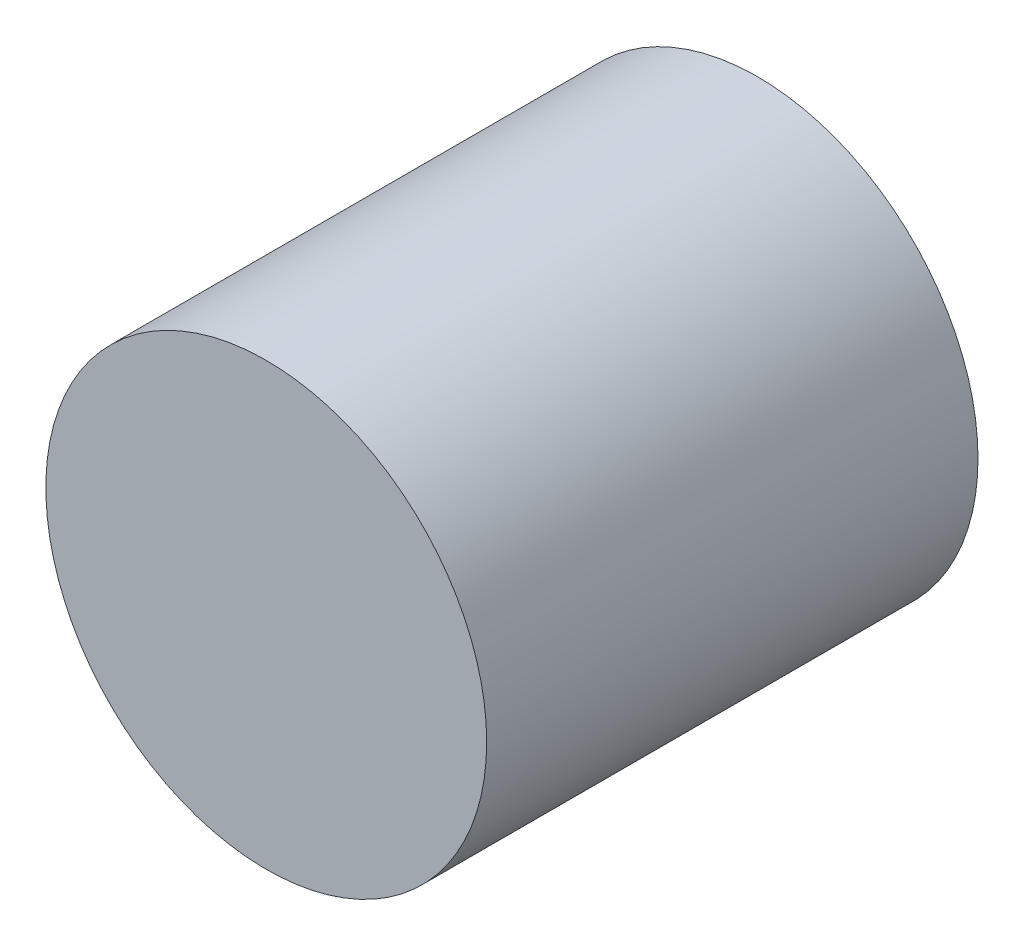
ISO-10303-21;
HEADER;
FILE_DESCRIPTION(('STEP AP214'),'2;1');
FILE_NAME('part.step','',(''),(''),'','','');
FILE_SCHEMA(('AUTOMOTIVE_DESIGN { 1 0 10303 214 1 1 1 1 }'));
ENDSEC;
DATA;
#1=APPLICATION_CONTEXT('core data for automotive mechanical design processes');
#2=APPLICATION_PROTOCOL_DEFINITION('international standard','automotive_design',2000,#1);
#3=PRODUCT_CONTEXT('',#1,'mechanical');
#4=PRODUCT('Part','Part','',(#3));
#5=PRODUCT_RELATED_PRODUCT_CATEGORY('part','',(#4));
#6=PRODUCT_DEFINITION_FORMATION('','',#4);
#7=PRODUCT_DEFINITION_CONTEXT('part definition',#1,'design');
#8=PRODUCT_DEFINITION('design','',#6,#7);
#9=PRODUCT_DEFINITION_SHAPE('','',#8);
#10=(LENGTH_UNIT() NAMED_UNIT(*) SI_UNIT(.MILLI.,.METRE.));
#11=(NAMED_UNIT(*) PLANE_ANGLE_UNIT() SI_UNIT($,.RADIAN.));
#12=(NAMED_UNIT(*) SI_UNIT($,.STERADIAN.) SOLID_ANGLE_UNIT());
#13=UNCERTAINTY_MEASURE_WITH_UNIT(LENGTH_MEASURE(1.E-05),#10,'distance_accuracy_value','');
#14=(GEOMETRIC_REPRESENTATION_CONTEXT(3) GLOBAL_UNCERTAINTY_ASSIGNED_CONTEXT((#13)) GLOBAL_UNIT_ASSIGNED_CONTEXT((#10,
#11,#12)) REPRESENTATION_CONTEXT('',''));
#15=CARTESIAN_POINT('',(0.,0.,0.));
#16=DIRECTION('',(0.,0.,1.));
#17=DIRECTION('',(1.,0.,0.));
#18=AXIS2_PLACEMENT_3D('',#15,#16,#17);
#19=CARTESIAN_POINT('',(0.,0.,8.054));
#20=DIRECTION('',(0.,0.,1.));
#21=DIRECTION('',(1.,0.,0.));
#22=AXIS2_PLACEMENT_3D('',#19,#20,#21);
#23=PLANE('',#22);
#24=CARTESIAN_POINT('',(0.,0.,8.054));
#25=DIRECTION('',(0.,0.,1.));
#26=DIRECTION('',(1.,0.,0.));
#27=AXIS2_PLACEMENT_3D('',#24,#25,#26);
#28=CIRCLE('',#27,3.23088);
#29=CARTESIAN_POINT('',(3.23088,0.,8.054));
#30=VERTEX_POINT('',#29);
#31=EDGE_CURVE('E18',#30,#30,#28,.F.);
#32=ORIENTED_EDGE('',*,*,#31,.F.);
#33=EDGE_LOOP('',(#32));
#34=FACE_BOUND('',#33,.T.);
#35=ADVANCED_FACE('F15',(#34),#23,.T.);
#36=CARTESIAN_POINT('',(0.,0.,0.853));
#37=DIRECTION('',(0.,0.,1.));
#38=DIRECTION('',(1.,0.,0.));
#39=AXIS2_PLACEMENT_3D('',#36,#37,#38);
#40=PLANE('',#39);
#41=CARTESIAN_POINT('',(0.,0.,0.853));
#42=DIRECTION('',(0.,0.,1.));
#43=DIRECTION('',(1.,0.,0.));
#44=AXIS2_PLACEMENT_3D('',#41,#42,#43);
#45=CIRCLE('',#44,3.23088);
#46=CARTESIAN_POINT('',(3.23088,0.,0.853));
#47=VERTEX_POINT('',#46);
#48=EDGE_CURVE('E10',#47,#47,#45,.T.);
#49=ORIENTED_EDGE('',*,*,#48,.F.);
#50=EDGE_LOOP('',(#49));
#51=FACE_BOUND('',#50,.T.);
#52=ADVANCED_FACE('F30',(#51),#40,.F.);
#53=CARTESIAN_POINT('',(0.,0.,0.853));
#54=DIRECTION('',(0.,0.,1.));
#55=DIRECTION('',(1.,0.,0.));
#56=AXIS2_PLACEMENT_3D('',#53,#54,#55);
#57=CYLINDRICAL_SURFACE('',#56,3.23088);
#58=ORIENTED_EDGE('',*,*,#48,.T.);
#59=EDGE_LOOP('',(#58));
#60=FACE_BOUND('',#59,.T.);
#61=ORIENTED_EDGE('',*,*,#31,.T.);
#62=EDGE_LOOP('',(#61));
#63=FACE_BOUND('',#62,.T.);
#64=ADVANCED_FACE('F27',(#60,#63),#57,.T.);
#65=CLOSED_SHELL('',(#35,#52,#64));
#66=MANIFOLD_SOLID_BREP('B1',#65);
#67=ADVANCED_BREP_SHAPE_REPRESENTATION('',(#18,#66),#14);
#68=SHAPE_DEFINITION_REPRESENTATION(#9,#67);
ENDSEC;
END-ISO-10303-21;
